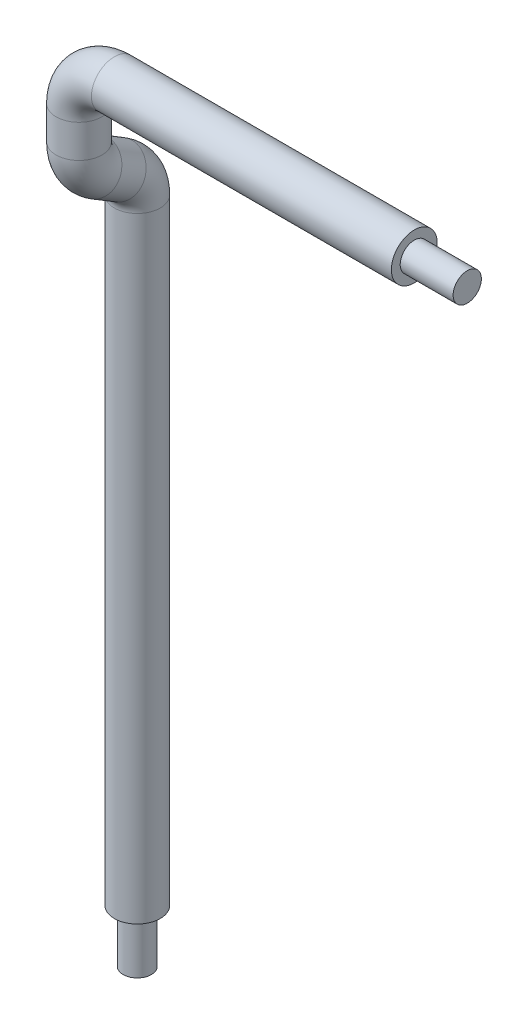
ISO-10303-21;
HEADER;
FILE_DESCRIPTION(('STEP AP214'),'2;1');
FILE_NAME('part.step','',(''),(''),'','','');
FILE_SCHEMA(('AUTOMOTIVE_DESIGN { 1 0 10303 214 1 1 1 1 }'));
ENDSEC;
DATA;
#1=APPLICATION_CONTEXT('core data for automotive mechanical design processes');
#2=APPLICATION_PROTOCOL_DEFINITION('international standard','automotive_design',2000,#1);
#3=PRODUCT_CONTEXT('',#1,'mechanical');
#4=PRODUCT('Part','Part','',(#3));
#5=PRODUCT_RELATED_PRODUCT_CATEGORY('part','',(#4));
#6=PRODUCT_DEFINITION_FORMATION('','',#4);
#7=PRODUCT_DEFINITION_CONTEXT('part definition',#1,'design');
#8=PRODUCT_DEFINITION('design','',#6,#7);
#9=PRODUCT_DEFINITION_SHAPE('','',#8);
#10=(LENGTH_UNIT() NAMED_UNIT(*) SI_UNIT(.MILLI.,.METRE.));
#11=(NAMED_UNIT(*) PLANE_ANGLE_UNIT() SI_UNIT($,.RADIAN.));
#12=(NAMED_UNIT(*) SI_UNIT($,.STERADIAN.) SOLID_ANGLE_UNIT());
#13=UNCERTAINTY_MEASURE_WITH_UNIT(LENGTH_MEASURE(1.E-05),#10,'distance_accuracy_value','');
#14=(GEOMETRIC_REPRESENTATION_CONTEXT(3) GLOBAL_UNCERTAINTY_ASSIGNED_CONTEXT((#13)) GLOBAL_UNIT_ASSIGNED_CONTEXT((#10,
#11,#12)) REPRESENTATION_CONTEXT('',''));
#15=CARTESIAN_POINT('',(0.,0.,0.));
#16=DIRECTION('',(0.,0.,1.));
#17=DIRECTION('',(1.,0.,0.));
#18=AXIS2_PLACEMENT_3D('',#15,#16,#17);
#19=CARTESIAN_POINT('',(8.,-8.,-17.25));
#20=DIRECTION('',(-1.,0.,0.));
#21=DIRECTION('',(0.,0.,1.));
#22=AXIS2_PLACEMENT_3D('',#19,#20,#21);
#23=PLANE('',#22);
#24=CARTESIAN_POINT('',(8.,-8.,-17.25));
#25=DIRECTION('',(1.,0.,0.));
#26=DIRECTION('',(0.,0.,-1.));
#27=AXIS2_PLACEMENT_3D('',#24,#25,#26);
#28=CIRCLE('',#27,0.4);
#29=CARTESIAN_POINT('',(8.,-8.,-17.65));
#30=VERTEX_POINT('',#29);
#31=EDGE_CURVE('E18',#30,#30,#28,.F.);
#32=ORIENTED_EDGE('',*,*,#31,.F.);
#33=EDGE_LOOP('',(#32));
#34=FACE_BOUND('',#33,.T.);
#35=ADVANCED_FACE('F15',(#34),#23,.F.);
#36=CARTESIAN_POINT('',(8.,-8.,-17.25));
#37=DIRECTION('',(1.,0.,0.));
#38=DIRECTION('',(0.,0.,-1.));
#39=AXIS2_PLACEMENT_3D('',#36,#37,#38);
#40=CYLINDRICAL_SURFACE('',#39,0.4);
#41=CARTESIAN_POINT('',(6.5,-8.,-17.25));
#42=DIRECTION('',(1.,0.,0.));
#43=DIRECTION('',(0.,0.,-1.));
#44=AXIS2_PLACEMENT_3D('',#41,#42,#43);
#45=CIRCLE('',#44,0.4);
#46=CARTESIAN_POINT('',(6.5,-8.,-17.65));
#47=VERTEX_POINT('',#46);
#48=EDGE_CURVE('E43',#47,#47,#45,.F.);
#49=ORIENTED_EDGE('',*,*,#48,.F.);
#50=EDGE_LOOP('',(#49));
#51=FACE_BOUND('',#50,.T.);
#52=ORIENTED_EDGE('',*,*,#31,.T.);
#53=EDGE_LOOP('',(#52));
#54=FACE_BOUND('',#53,.T.);
#55=ADVANCED_FACE('F50',(#51,#54),#40,.T.);
#56=CARTESIAN_POINT('',(6.5,0.,0.));
#57=DIRECTION('',(1.,0.,0.));
#58=DIRECTION('',(0.,0.,-1.));
#59=AXIS2_PLACEMENT_3D('',#56,#57,#58);
#60=PLANE('',#59);
#61=ORIENTED_EDGE('',*,*,#48,.T.);
#62=EDGE_LOOP('',(#61));
#63=FACE_BOUND('',#62,.T.);
#64=CARTESIAN_POINT('',(6.5,-8.,-17.25));
#65=DIRECTION('',(-1.,0.,0.));
#66=DIRECTION('',(0.,0.,1.));
#67=AXIS2_PLACEMENT_3D('',#64,#65,#66);
#68=CIRCLE('',#67,0.65);
#69=CARTESIAN_POINT('',(6.5,-8.,-16.6));
#70=VERTEX_POINT('',#69);
#71=EDGE_CURVE('E40',#70,#70,#68,.T.);
#72=ORIENTED_EDGE('',*,*,#71,.F.);
#73=EDGE_LOOP('',(#72));
#74=FACE_BOUND('',#73,.T.);
#75=ADVANCED_FACE('F57',(#63,#74),#60,.T.);
#76=CARTESIAN_POINT('',(8.,-8.,-17.25));
#77=DIRECTION('',(-1.,0.,0.));
#78=DIRECTION('',(0.,0.,1.));
#79=AXIS2_PLACEMENT_3D('',#76,#77,#78);
#80=CYLINDRICAL_SURFACE('',#79,0.65);
#81=CARTESIAN_POINT('',(-2.,-8.,-17.25));
#82=DIRECTION('',(-1.,0.,0.));
#83=DIRECTION('',(0.,1.,0.));
#84=AXIS2_PLACEMENT_3D('',#81,#82,#83);
#85=CIRCLE('',#84,0.65);
#86=CARTESIAN_POINT('',(-2.,-7.35,-17.25));
#87=VERTEX_POINT('',#86);
#88=EDGE_CURVE('E42',#87,#87,#85,.T.);
#89=ORIENTED_EDGE('',*,*,#88,.F.);
#90=EDGE_LOOP('',(#89));
#91=FACE_BOUND('',#90,.T.);
#92=ORIENTED_EDGE('',*,*,#71,.T.);
#93=EDGE_LOOP('',(#92));
#94=FACE_BOUND('',#93,.T.);
#95=ADVANCED_FACE('F99',(#91,#94),#80,.T.);
#96=CARTESIAN_POINT('',(-2.,-9.,-17.25));
#97=DIRECTION('',(0.,0.,1.));
#98=DIRECTION('',(0.,-1.,0.));
#99=AXIS2_PLACEMENT_3D('',#96,#97,#98);
#100=TOROIDAL_SURFACE('',#99,1.,0.65);
#101=CARTESIAN_POINT('',(-3.,-9.,-17.25));
#102=DIRECTION('',(0.,-1.,0.));
#103=DIRECTION('',(0.,0.,-1.));
#104=AXIS2_PLACEMENT_3D('',#101,#102,#103);
#105=CIRCLE('',#104,0.65);
#106=CARTESIAN_POINT('',(-3.,-9.,-17.9));
#107=VERTEX_POINT('',#106);
#108=EDGE_CURVE('E31',#107,#107,#105,.T.);
#109=ORIENTED_EDGE('',*,*,#108,.F.);
#110=EDGE_LOOP('',(#109));
#111=FACE_BOUND('',#110,.T.);
#112=ORIENTED_EDGE('',*,*,#88,.T.);
#113=EDGE_LOOP('',(#112));
#114=FACE_BOUND('',#113,.T.);
#115=ADVANCED_FACE('F94',(#111,#114),#100,.T.);
#116=CARTESIAN_POINT('',(-3.,-9.,-17.25));
#117=DIRECTION('',(0.,-1.,0.));
#118=DIRECTION('',(0.,0.,-1.));
#119=AXIS2_PLACEMENT_3D('',#116,#117,#118);
#120=CYLINDRICAL_SURFACE('',#119,0.65);
#121=CARTESIAN_POINT('',(-3.,-9.936740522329,-17.25));
#122=DIRECTION('',(0.,-1.,0.));
#123=DIRECTION('',(0.,0.,1.));
#124=AXIS2_PLACEMENT_3D('',#121,#122,#123);
#125=CIRCLE('',#124,0.65);
#126=CARTESIAN_POINT('',(-3.,-9.936740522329,-16.6));
#127=VERTEX_POINT('',#126);
#128=EDGE_CURVE('E103',#127,#127,#125,.T.);
#129=ORIENTED_EDGE('',*,*,#128,.F.);
#130=EDGE_LOOP('',(#129));
#131=FACE_BOUND('',#130,.T.);
#132=ORIENTED_EDGE('',*,*,#108,.T.);
#133=EDGE_LOOP('',(#132));
#134=FACE_BOUND('',#133,.T.);
#135=ADVANCED_FACE('F90',(#131,#134),#120,.T.);
#136=CARTESIAN_POINT('',(-3.,-9.936740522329,-18.25));
#137=DIRECTION('',(1.,0.,0.));
#138=DIRECTION('',(0.,0.,-1.));
#139=AXIS2_PLACEMENT_3D('',#136,#137,#138);
#140=TOROIDAL_SURFACE('',#139,1.,0.65);
#141=CARTESIAN_POINT('',(-3.,-10.7919383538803,-17.7316982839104));
#142=DIRECTION('',(0.,-0.51830171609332,-0.855197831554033));
#143=DIRECTION('',(0.,0.855197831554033,-0.51830171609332));
#144=AXIS2_PLACEMENT_3D('',#141,#142,#143);
#145=CIRCLE('',#144,0.65);
#146=CARTESIAN_POINT('',(-3.,-10.2360597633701,-18.0685943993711));
#147=VERTEX_POINT('',#146);
#148=EDGE_CURVE('E39',#147,#147,#145,.T.);
#149=ORIENTED_EDGE('',*,*,#148,.F.);
#150=EDGE_LOOP('',(#149));
#151=FACE_BOUND('',#150,.T.);
#152=ORIENTED_EDGE('',*,*,#128,.T.);
#153=EDGE_LOOP('',(#152));
#154=FACE_BOUND('',#153,.T.);
#155=ADVANCED_FACE('F85',(#151,#154),#140,.T.);
#156=CARTESIAN_POINT('',(-3.,-31.,-18.9));
#157=DIRECTION('',(0.,-1.,0.));
#158=DIRECTION('',(0.,0.,-1.));
#159=AXIS2_PLACEMENT_3D('',#156,#157,#158);
#160=PLANE('',#159);
#161=CARTESIAN_POINT('',(-3.,-31.,-18.9));
#162=DIRECTION('',(0.,-1.,0.));
#163=DIRECTION('',(0.,0.,-1.));
#164=AXIS2_PLACEMENT_3D('',#161,#162,#163);
#165=CIRCLE('',#164,0.4);
#166=CARTESIAN_POINT('',(-3.,-31.,-19.3));
#167=VERTEX_POINT('',#166);
#168=EDGE_CURVE('E36',#167,#167,#165,.F.);
#169=ORIENTED_EDGE('',*,*,#168,.F.);
#170=EDGE_LOOP('',(#169));
#171=FACE_BOUND('',#170,.T.);
#172=ADVANCED_FACE('F89',(#171),#160,.T.);
#173=CARTESIAN_POINT('',(-3.,-10.79193835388,-17.73169828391));
#174=DIRECTION('',(0.,-0.51830171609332,-0.855197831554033));
#175=DIRECTION('',(0.,0.855197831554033,-0.51830171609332));
#176=AXIS2_PLACEMENT_3D('',#173,#174,#175);
#177=CYLINDRICAL_SURFACE('',#176,0.65);
#178=CARTESIAN_POINT('',(-3.,-11.2080616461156,-18.4183017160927));
#179=DIRECTION('',(0.,-0.518301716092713,-0.8551978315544));
#180=DIRECTION('',(0.,0.8551978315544,-0.518301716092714));
#181=AXIS2_PLACEMENT_3D('',#178,#179,#180);
#182=CIRCLE('',#181,0.65);
#183=CARTESIAN_POINT('',(-3.,-10.6521830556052,-18.755197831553));
#184=VERTEX_POINT('',#183);
#185=EDGE_CURVE('E35',#184,#184,#182,.T.);
#186=ORIENTED_EDGE('',*,*,#185,.F.);
#187=EDGE_LOOP('',(#186));
#188=FACE_BOUND('',#187,.T.);
#189=ORIENTED_EDGE('',*,*,#148,.T.);
#190=EDGE_LOOP('',(#189));
#191=FACE_BOUND('',#190,.T.);
#192=ADVANCED_FACE('F116',(#188,#191),#177,.T.);
#193=CARTESIAN_POINT('',(-3.,-21.,-18.9));
#194=DIRECTION('',(0.,-1.,0.));
#195=DIRECTION('',(0.,0.,-1.));
#196=AXIS2_PLACEMENT_3D('',#193,#194,#195);
#197=CYLINDRICAL_SURFACE('',#196,0.4);
#198=CARTESIAN_POINT('',(-3.,-29.5,-18.9));
#199=DIRECTION('',(0.,-1.,0.));
#200=DIRECTION('',(0.,0.,-1.));
#201=AXIS2_PLACEMENT_3D('',#198,#199,#200);
#202=CIRCLE('',#201,0.4);
#203=CARTESIAN_POINT('',(-3.,-29.5,-19.3));
#204=VERTEX_POINT('',#203);
#205=EDGE_CURVE('E27',#204,#204,#202,.F.);
#206=ORIENTED_EDGE('',*,*,#205,.F.);
#207=EDGE_LOOP('',(#206));
#208=FACE_BOUND('',#207,.T.);
#209=ORIENTED_EDGE('',*,*,#168,.T.);
#210=EDGE_LOOP('',(#209));
#211=FACE_BOUND('',#210,.T.);
#212=ADVANCED_FACE('F74',(#208,#211),#197,.T.);
#213=CARTESIAN_POINT('',(-3.,-12.06325947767,-17.9));
#214=DIRECTION('',(-1.,0.,0.));
#215=DIRECTION('',(0.,-0.855197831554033,0.518301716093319));
#216=AXIS2_PLACEMENT_3D('',#213,#214,#215);
#217=TOROIDAL_SURFACE('',#216,0.999999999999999,0.65);
#218=CARTESIAN_POINT('',(-3.,-12.06325947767,-18.9));
#219=DIRECTION('',(0.,-1.,0.));
#220=DIRECTION('',(0.,0.,-1.));
#221=AXIS2_PLACEMENT_3D('',#218,#219,#220);
#222=CIRCLE('',#221,0.65);
#223=CARTESIAN_POINT('',(-3.,-12.06325947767,-19.55));
#224=VERTEX_POINT('',#223);
#225=EDGE_CURVE('E22',#224,#224,#222,.T.);
#226=ORIENTED_EDGE('',*,*,#225,.F.);
#227=EDGE_LOOP('',(#226));
#228=FACE_BOUND('',#227,.T.);
#229=ORIENTED_EDGE('',*,*,#185,.T.);
#230=EDGE_LOOP('',(#229));
#231=FACE_BOUND('',#230,.T.);
#232=ADVANCED_FACE('F67',(#228,#231),#217,.T.);
#233=CARTESIAN_POINT('',(0.,-29.5,0.));
#234=DIRECTION('',(0.,-1.,0.));
#235=DIRECTION('',(0.,0.,-1.));
#236=AXIS2_PLACEMENT_3D('',#233,#234,#235);
#237=PLANE('',#236);
#238=ORIENTED_EDGE('',*,*,#205,.T.);
#239=EDGE_LOOP('',(#238));
#240=FACE_BOUND('',#239,.T.);
#241=CARTESIAN_POINT('',(-3.,-29.5,-18.9));
#242=DIRECTION('',(0.,-1.,0.));
#243=DIRECTION('',(0.,0.,-1.));
#244=AXIS2_PLACEMENT_3D('',#241,#242,#243);
#245=CIRCLE('',#244,0.65);
#246=CARTESIAN_POINT('',(-3.,-29.5,-19.55));
#247=VERTEX_POINT('',#246);
#248=EDGE_CURVE('E10',#247,#247,#245,.F.);
#249=ORIENTED_EDGE('',*,*,#248,.F.);
#250=EDGE_LOOP('',(#249));
#251=FACE_BOUND('',#250,.T.);
#252=ADVANCED_FACE('F61',(#240,#251),#237,.T.);
#253=CARTESIAN_POINT('',(-3.,-12.06325947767,-18.9));
#254=DIRECTION('',(0.,-1.,0.));
#255=DIRECTION('',(0.,0.,-1.));
#256=AXIS2_PLACEMENT_3D('',#253,#254,#255);
#257=CYLINDRICAL_SURFACE('',#256,0.65);
#258=ORIENTED_EDGE('',*,*,#225,.T.);
#259=EDGE_LOOP('',(#258));
#260=FACE_BOUND('',#259,.T.);
#261=ORIENTED_EDGE('',*,*,#248,.T.);
#262=EDGE_LOOP('',(#261));
#263=FACE_BOUND('',#262,.T.);
#264=ADVANCED_FACE('F59',(#260,#263),#257,.T.);
#265=CLOSED_SHELL('',(#35,#55,#75,#95,#115,#135,#155,#172,#192,#212,#232,#252,#264));
#266=MANIFOLD_SOLID_BREP('B1',#265);
#267=ADVANCED_BREP_SHAPE_REPRESENTATION('',(#18,#266),#14);
#268=SHAPE_DEFINITION_REPRESENTATION(#9,#267);
ENDSEC;
END-ISO-10303-21;
